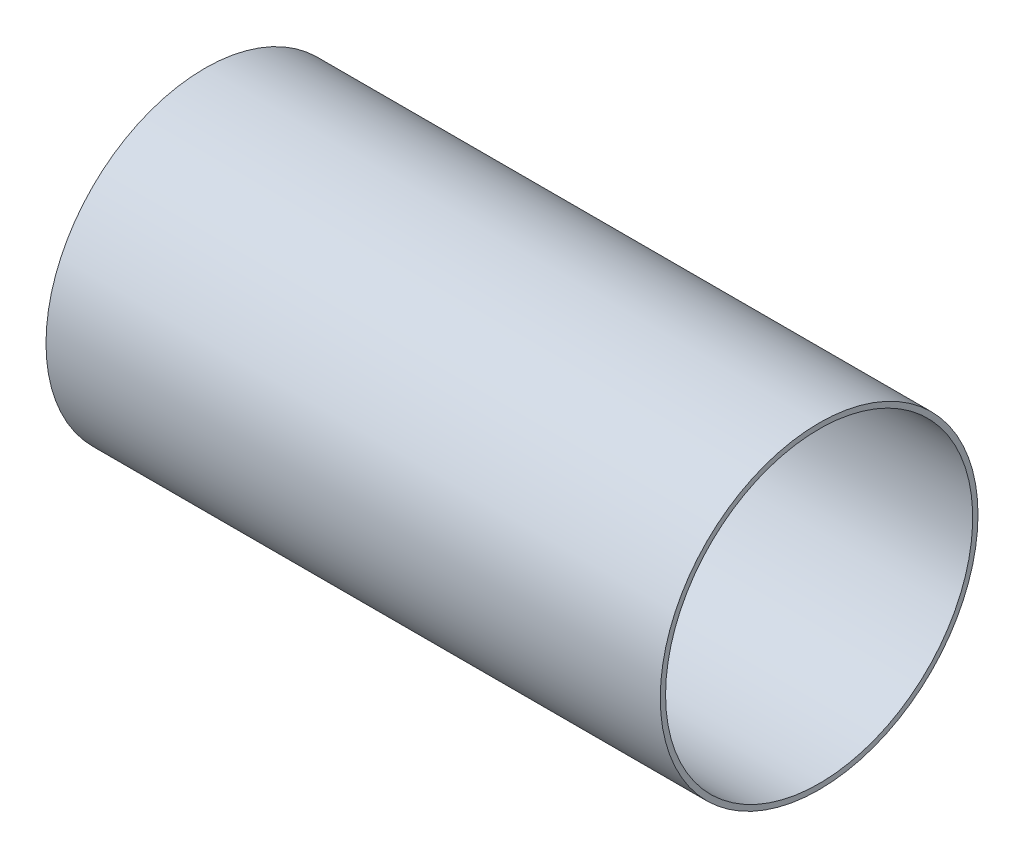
from build123d import *


with BuildPart() as part:
    # Esquisse1 → R_vol.-Mince1 (revolve)
    with BuildSketch(Plane.XY, mode=Mode.PRIVATE) as r_vol_mince1_sk:
        Polygon((0.8, 0.8), (0, 0.8), (0, 3), (11.6, 3), (11.6, 2.9), (0.1, 2.9), (0.1, 0.9), (0.8, 0.9), align=None)
    revolve(r_vol_mince1_sk.sketch.rotate(Axis((0, 0, 0), (1, 0, 0)), 90), axis=Axis((0, 0, 0), (1, 0, 0)))


solid = part.part
